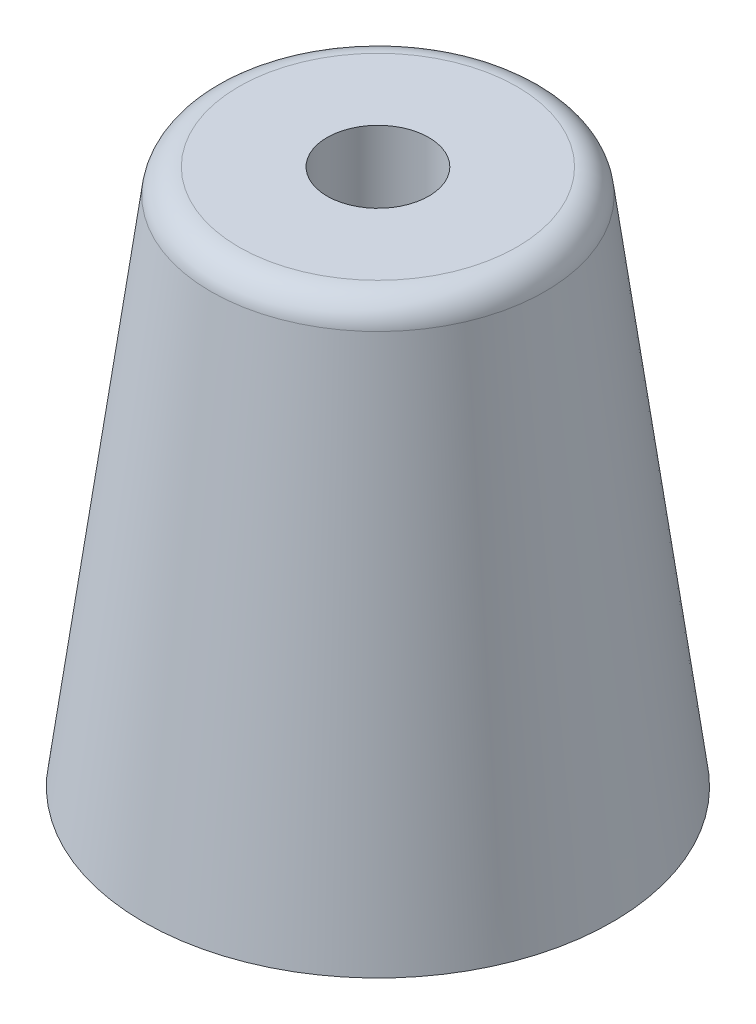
ISO-10303-21;
HEADER;
FILE_DESCRIPTION(('STEP AP214'),'2;1');
FILE_NAME('part.step','',(''),(''),'','','');
FILE_SCHEMA(('AUTOMOTIVE_DESIGN { 1 0 10303 214 1 1 1 1 }'));
ENDSEC;
DATA;
#1=APPLICATION_CONTEXT('core data for automotive mechanical design processes');
#2=APPLICATION_PROTOCOL_DEFINITION('international standard','automotive_design',2000,#1);
#3=PRODUCT_CONTEXT('',#1,'mechanical');
#4=PRODUCT('Part','Part','',(#3));
#5=PRODUCT_RELATED_PRODUCT_CATEGORY('part','',(#4));
#6=PRODUCT_DEFINITION_FORMATION('','',#4);
#7=PRODUCT_DEFINITION_CONTEXT('part definition',#1,'design');
#8=PRODUCT_DEFINITION('design','',#6,#7);
#9=PRODUCT_DEFINITION_SHAPE('','',#8);
#10=(LENGTH_UNIT() NAMED_UNIT(*) SI_UNIT(.MILLI.,.METRE.));
#11=(NAMED_UNIT(*) PLANE_ANGLE_UNIT() SI_UNIT($,.RADIAN.));
#12=(NAMED_UNIT(*) SI_UNIT($,.STERADIAN.) SOLID_ANGLE_UNIT());
#13=UNCERTAINTY_MEASURE_WITH_UNIT(LENGTH_MEASURE(1.E-05),#10,'distance_accuracy_value','');
#14=(GEOMETRIC_REPRESENTATION_CONTEXT(3) GLOBAL_UNCERTAINTY_ASSIGNED_CONTEXT((#13)) GLOBAL_UNIT_ASSIGNED_CONTEXT((#10,
#11,#12)) REPRESENTATION_CONTEXT('',''));
#15=CARTESIAN_POINT('',(0.,0.,0.));
#16=DIRECTION('',(0.,0.,1.));
#17=DIRECTION('',(1.,0.,0.));
#18=AXIS2_PLACEMENT_3D('',#15,#16,#17);
#19=CARTESIAN_POINT('',(0.,45.,0.));
#20=DIRECTION('',(0.,-1.,0.));
#21=DIRECTION('',(0.,0.,-1.));
#22=AXIS2_PLACEMENT_3D('',#19,#20,#21);
#23=PLANE('',#22);
#24=CARTESIAN_POINT('',(0.,45.,0.));
#25=DIRECTION('',(0.,-1.,0.));
#26=DIRECTION('',(0.,0.,-1.));
#27=AXIS2_PLACEMENT_3D('',#24,#25,#26);
#28=CIRCLE('',#27,5.5);
#29=CARTESIAN_POINT('',(0.,45.,-5.5));
#30=VERTEX_POINT('',#29);
#31=EDGE_CURVE('E119',#30,#30,#28,.F.);
#32=ORIENTED_EDGE('',*,*,#31,.T.);
#33=EDGE_LOOP('',(#32));
#34=FACE_BOUND('',#33,.T.);
#35=CARTESIAN_POINT('',(0.,45.,0.));
#36=DIRECTION('',(0.,-1.,0.));
#37=DIRECTION('',(0.,0.,-1.));
#38=AXIS2_PLACEMENT_3D('',#35,#36,#37);
#39=CIRCLE('',#38,22.9422863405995);
#40=CARTESIAN_POINT('',(3.5,45.,-22.6737403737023));
#41=VERTEX_POINT('',#40);
#42=CARTESIAN_POINT('',(-3.49999999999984,45.,-22.6737403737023));
#43=VERTEX_POINT('',#42);
#44=EDGE_CURVE('E116',#41,#43,#39,.T.);
#45=ORIENTED_EDGE('',*,*,#44,.T.);
#46=DIRECTION('',(1.,0.,0.));
#47=VECTOR('',#46,1.);
#48=CARTESIAN_POINT('',(0.,45.,-22.6737403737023));
#49=LINE('',#48,#47);
#50=EDGE_CURVE('E101',#43,#41,#49,.T.);
#51=ORIENTED_EDGE('',*,*,#50,.T.);
#52=EDGE_LOOP('',(#45,#51));
#53=FACE_BOUND('',#52,.T.);
#54=ADVANCED_FACE('F37',(#34,#53),#23,.T.);
#55=CARTESIAN_POINT('',(0.,0.,0.));
#56=DIRECTION('',(0.,-1.,0.));
#57=DIRECTION('',(0.,0.,-1.));
#58=AXIS2_PLACEMENT_3D('',#55,#56,#57);
#59=CONICAL_SURFACE('',#58,35.,0.26179938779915);
#60=CARTESIAN_POINT('',(0.,0.,0.));
#61=DIRECTION('',(0.,-1.,0.));
#62=DIRECTION('',(0.,0.,-1.));
#63=AXIS2_PLACEMENT_3D('',#60,#61,#62);
#64=CIRCLE('',#63,35.);
#65=CARTESIAN_POINT('',(0.,0.,-35.));
#66=VERTEX_POINT('',#65);
#67=EDGE_CURVE('E113',#66,#66,#64,.T.);
#68=ORIENTED_EDGE('',*,*,#67,.T.);
#69=EDGE_LOOP('',(#68));
#70=FACE_BOUND('',#69,.T.);
#71=CARTESIAN_POINT('',(-3.5,62.193847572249,-17.9980521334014));
#72=CARTESIAN_POINT('',(-3.5,59.8519484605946,-18.6372798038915));
#73=CARTESIAN_POINT('',(-3.5,57.5097540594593,-19.2754241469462));
#74=CARTESIAN_POINT('',(-3.5,52.8248968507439,-20.549989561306));
#75=CARTESIAN_POINT('',(-3.5,50.4822340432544,-21.1864106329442));
#76=CARTESIAN_POINT('',(-3.5,45.7965625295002,-22.4579727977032));
#77=CARTESIAN_POINT('',(-3.5,43.4535538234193,-23.0931138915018));
#78=CARTESIAN_POINT('',(-3.5,38.7672636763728,-24.3623895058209));
#79=CARTESIAN_POINT('',(-3.5,36.4239822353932,-24.9965240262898));
#80=CARTESIAN_POINT('',(-3.5,30.8114464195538,-26.514356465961));
#81=CARTESIAN_POINT('',(-3.5,27.5420903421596,-27.3976782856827));
#82=CARTESIAN_POINT('',(-3.5,21.0030666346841,-29.1631703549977));
#83=CARTESIAN_POINT('',(-3.5,17.7333990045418,-30.0453406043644));
#84=CARTESIAN_POINT('',(-3.5,10.4848742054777,-31.9999755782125));
#85=CARTESIAN_POINT('',(-3.5,6.50595992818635,-33.0722285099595));
#86=CARTESIAN_POINT('',(-3.49999999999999,-1.45212984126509,-35.2157647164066));
#87=CARTESIAN_POINT('',(-3.49999999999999,-5.43130533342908,-36.2870479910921));
#88=CARTESIAN_POINT('',(-3.49999999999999,-13.3898530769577,-38.4288739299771));
#89=CARTESIAN_POINT('',(-3.49999999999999,-17.3692253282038,-39.4994165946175));
#90=CARTESIAN_POINT('',(-3.49999999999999,-25.3281276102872,-41.639914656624));
#91=CARTESIAN_POINT('',(-3.49999999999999,-29.3076576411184,-42.709870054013));
#92=CARTESIAN_POINT('',(-3.49999999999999,-33.2872460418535,-43.7796082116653));
#93=B_SPLINE_CURVE_WITH_KNOTS('',3,(#71,#72,#73,#74,#75,#76,#77,#78,#79,#80,#81,#82,#83,#84,#85,
#86,#87,#88,#89,#90,#91,#92),.UNSPECIFIED.,.F.,.F.,(4,2,2,2,2,2,2,2,2,2,4),(0.,7.28271372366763,
14.5654260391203,21.8481344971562,29.1308433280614,39.2905929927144,49.4503446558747,
61.8129237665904,74.175503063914,86.5380749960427,98.9006464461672),.UNSPECIFIED.);
#94=CARTESIAN_POINT('',(-3.5,12.6600265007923,-31.4133768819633));
#95=VERTEX_POINT('',#94);
#96=EDGE_CURVE('E146',#43,#95,#93,.T.);
#97=ORIENTED_EDGE('',*,*,#96,.F.);
#98=ORIENTED_EDGE('',*,*,#44,.F.);
#99=CARTESIAN_POINT('',(3.50000000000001,-33.2872460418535,-43.7796082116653));
#100=CARTESIAN_POINT('',(3.50000000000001,-29.3076550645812,-42.709869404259));
#101=CARTESIAN_POINT('',(3.50000000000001,-25.3281224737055,-41.6399132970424));
#102=CARTESIAN_POINT('',(3.50000000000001,-17.3692151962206,-39.4994138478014));
#103=CARTESIAN_POINT('',(3.50000000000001,-13.3898405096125,-38.4288705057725));
#104=CARTESIAN_POINT('',(3.50000000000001,-5.43129293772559,-36.2870446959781));
#105=CARTESIAN_POINT('',(3.50000000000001,-1.45212005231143,-35.2157622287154));
#106=CARTESIAN_POINT('',(3.5,6.50596463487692,-33.0722270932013));
#107=CARTESIAN_POINT('',(3.5,10.4848764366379,-31.9999744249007));
#108=CARTESIAN_POINT('',(3.5,18.4423517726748,-29.8541651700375));
#109=CARTESIAN_POINT('',(3.5,22.4209153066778,-28.7806085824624));
#110=CARTESIAN_POINT('',(3.5,30.377555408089,-26.6316937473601));
#111=CARTESIAN_POINT('',(3.5,34.3556319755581,-25.5563355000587));
#112=CARTESIAN_POINT('',(3.5,40.3222163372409,-23.9413322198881));
#113=CARTESIAN_POINT('',(3.5,42.3109901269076,-23.4026699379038));
#114=CARTESIAN_POINT('',(3.5,46.2883176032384,-22.3245336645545));
#115=CARTESIAN_POINT('',(3.5,48.276871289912,-21.7850596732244));
#116=CARTESIAN_POINT('',(3.5,52.2537073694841,-20.7051091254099));
#117=CARTESIAN_POINT('',(3.5,54.241989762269,-20.1646325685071));
#118=CARTESIAN_POINT('',(3.5,58.2182026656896,-19.0823855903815));
#119=CARTESIAN_POINT('',(3.5,60.2061331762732,-18.5406151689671));
#120=CARTESIAN_POINT('',(3.5,62.193847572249,-17.9980521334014));
#121=B_SPLINE_CURVE_WITH_KNOTS('',3,(#99,#100,#101,#102,#103,#104,#105,#106,#107,#108,#109,#110,
#111,#112,#113,#114,#115,#116,#117,#118,#119,#120),.UNSPECIFIED.,.F.,.F.,(4,2,2,2,2,2,2,2,2,2,
4),(0.,12.3625794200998,24.7251589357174,37.0877300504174,49.4503017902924,61.8128831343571,
74.1754629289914,80.3567574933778,86.5380517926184,92.7193486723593,98.9006464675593),.UNSPECIFIED.);
#122=CARTESIAN_POINT('',(3.5,12.6600265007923,-31.4133768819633));
#123=VERTEX_POINT('',#122);
#124=EDGE_CURVE('E97',#123,#41,#121,.T.);
#125=ORIENTED_EDGE('',*,*,#124,.F.);
#126=CARTESIAN_POINT('',(3.5,12.6600265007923,-31.4133768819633));
#127=CARTESIAN_POINT('',(3.50000975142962,12.5652421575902,-31.4389269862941));
#128=CARTESIAN_POINT('',(3.49586997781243,12.4705803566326,-31.4649126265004));
#129=CARTESIAN_POINT('',(3.47936729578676,12.2821661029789,-31.517536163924));
#130=CARTESIAN_POINT('',(3.46700496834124,12.1884135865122,-31.5441740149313));
#131=CARTESIAN_POINT('',(3.43414928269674,12.0025602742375,-31.5978603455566));
#132=CARTESIAN_POINT('',(3.4136639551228,11.910457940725,-31.6249083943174));
#133=CARTESIAN_POINT('',(3.36473285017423,11.7284777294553,-31.6791878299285));
#134=CARTESIAN_POINT('',(3.33628712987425,11.6385998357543,-31.706419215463));
#135=CARTESIAN_POINT('',(3.23925416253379,11.3731619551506,-31.7880314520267));
#136=CARTESIAN_POINT('',(3.15895401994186,11.2017017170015,-31.8423582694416));
#137=CARTESIAN_POINT('',(2.96953877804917,10.8748305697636,-31.9485418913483));
#138=CARTESIAN_POINT('',(2.86042622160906,10.7194182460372,-32.0003989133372));
#139=CARTESIAN_POINT('',(2.61598618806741,10.4280858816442,-32.0996299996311));
#140=CARTESIAN_POINT('',(2.48056696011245,10.2922370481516,-32.146987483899));
#141=CARTESIAN_POINT('',(2.18753469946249,10.0442824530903,-32.2348465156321));
#142=CARTESIAN_POINT('',(2.02991745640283,9.93218120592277,-32.2753467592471));
#143=CARTESIAN_POINT('',(1.69655179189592,9.73447649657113,-32.3476343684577));
#144=CARTESIAN_POINT('',(1.52076229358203,9.6489348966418,-32.3794013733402));
#145=CARTESIAN_POINT('',(1.15635365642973,9.50703015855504,-32.4325064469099));
#146=CARTESIAN_POINT('',(0.967742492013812,9.45064906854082,-32.4538509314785));
#147=CARTESIAN_POINT('',(0.64832976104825,9.38244098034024,-32.4797628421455));
#148=CARTESIAN_POINT('',(0.519556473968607,9.36199403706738,-32.4875631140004));
#149=CARTESIAN_POINT('',(0.260540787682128,9.33471531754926,-32.4979866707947));
#150=CARTESIAN_POINT('',(0.130300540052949,9.32786569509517,-32.5006167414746));
#151=CARTESIAN_POINT('',(0.,9.32788091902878,-32.5006018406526));
#152=B_SPLINE_CURVE_WITH_KNOTS('',3,(#126,#127,#128,#129,#130,#131,#132,#133,#134,#135,#136,
#137,#138,#139,#140,#141,#142,#143,#144,#145,#146,#147,#148,#149,#150,#151),.UNSPECIFIED.,.F.,
.F.,(4,2,2,2,2,2,2,2,2,2,2,2,4),(0.,0.294405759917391,0.588790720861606,0.882885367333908,
1.17697790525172,1.76486241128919,2.3526950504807,2.94261595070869,3.53264889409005,
4.12404599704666,4.71507858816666,5.10617073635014,5.49674924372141),.UNSPECIFIED.);
#153=CARTESIAN_POINT('',(0.,9.32788091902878,-32.5006018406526));
#154=VERTEX_POINT('',#153);
#155=EDGE_CURVE('E11',#123,#154,#152,.T.);
#156=ORIENTED_EDGE('',*,*,#155,.T.);
#157=CARTESIAN_POINT('',(0.,9.32788091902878,-32.5006018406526));
#158=CARTESIAN_POINT('',(-0.0981570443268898,9.32787254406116,-32.5006082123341));
#159=CARTESIAN_POINT('',(-0.196309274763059,9.3317582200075,-32.4991183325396));
#160=CARTESIAN_POINT('',(-0.391906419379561,9.34725247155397,-32.4931940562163));
#161=CARTESIAN_POINT('',(-0.489351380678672,9.35886052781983,-32.4887598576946));
#162=CARTESIAN_POINT('',(-0.682755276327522,9.38971929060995,-32.4770006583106));
#163=CARTESIAN_POINT('',(-0.778715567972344,9.40896252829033,-32.4696784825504));
#164=CARTESIAN_POINT('',(-0.968536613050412,9.45494280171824,-32.4522455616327));
#165=CARTESIAN_POINT('',(-1.06239738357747,9.4816797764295,-32.4421348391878));
#166=CARTESIAN_POINT('',(-1.3399103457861,9.57292342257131,-32.4077844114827));
#167=CARTESIAN_POINT('',(-1.51959017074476,9.64847835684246,-32.3795204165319));
#168=CARTESIAN_POINT('',(-1.86280486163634,9.82692718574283,-32.3136988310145));
#169=CARTESIAN_POINT('',(-2.02634125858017,9.92981848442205,-32.2761421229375));
#170=CARTESIAN_POINT('',(-2.33338285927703,10.1606538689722,-32.1933879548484));
#171=CARTESIAN_POINT('',(-2.47682007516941,10.288679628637,-32.148165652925));
#172=CARTESIAN_POINT('',(-2.73899912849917,10.566222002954,-32.0522549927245));
#173=CARTESIAN_POINT('',(-2.85773608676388,10.7157428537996,-32.0015655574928));
#174=CARTESIAN_POINT('',(-3.06742408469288,11.0327103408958,-31.896828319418));
#175=CARTESIAN_POINT('',(-3.15829870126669,11.2002046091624,-31.8427717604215));
#176=CARTESIAN_POINT('',(-3.30916618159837,11.5482219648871,-31.7336933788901));
#177=CARTESIAN_POINT('',(-3.36917820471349,11.7287368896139,-31.6786721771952));
#178=CARTESIAN_POINT('',(-3.4418318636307,12.0352554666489,-31.5882232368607));
#179=CARTESIAN_POINT('',(-3.46362809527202,12.1590669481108,-31.5524572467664));
#180=CARTESIAN_POINT('',(-3.49271207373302,12.4085066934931,-31.4819998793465));
#181=CARTESIAN_POINT('',(-3.50001866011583,12.5341323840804,-31.4473071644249));
#182=CARTESIAN_POINT('',(-3.5,12.6600265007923,-31.4133768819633));
#183=B_SPLINE_CURVE_WITH_KNOTS('',3,(#157,#158,#159,#160,#161,#162,#163,#164,#165,#166,#167,
#168,#169,#170,#171,#172,#173,#174,#175,#176,#177,#178,#179,#180,#181,#182),.UNSPECIFIED.,.F.,
.F.,(4,2,2,2,2,2,2,2,2,2,2,2,4),(0.,0.294374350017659,0.58872890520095,0.882796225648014,
1.17686115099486,1.76469950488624,2.35248205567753,2.94220718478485,3.53204869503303,
4.12349388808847,4.71457147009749,5.10591532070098,5.49675000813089),.UNSPECIFIED.);
#184=EDGE_CURVE('E47',#154,#95,#183,.T.);
#185=ORIENTED_EDGE('',*,*,#184,.T.);
#186=EDGE_LOOP('',(#97,#98,#125,#156,#185));
#187=FACE_BOUND('',#186,.T.);
#188=ADVANCED_FACE('F152',(#70,#187),#59,.F.);
#189=CARTESIAN_POINT('',(0.,0.,0.));
#190=DIRECTION('',(0.,1.,0.));
#191=DIRECTION('',(0.,0.,1.));
#192=AXIS2_PLACEMENT_3D('',#189,#190,#191);
#193=CYLINDRICAL_SURFACE('',#192,5.5);
#194=CARTESIAN_POINT('',(0.,55.,0.));
#195=DIRECTION('',(0.,1.,0.));
#196=DIRECTION('',(0.,0.,1.));
#197=AXIS2_PLACEMENT_3D('',#194,#195,#196);
#198=CIRCLE('',#197,5.5);
#199=CARTESIAN_POINT('',(0.,55.,5.5));
#200=VERTEX_POINT('',#199);
#201=EDGE_CURVE('E120',#200,#200,#198,.T.);
#202=ORIENTED_EDGE('',*,*,#201,.T.);
#203=EDGE_LOOP('',(#202));
#204=FACE_BOUND('',#203,.T.);
#205=ORIENTED_EDGE('',*,*,#31,.F.);
#206=EDGE_LOOP('',(#205));
#207=FACE_BOUND('',#206,.T.);
#208=ADVANCED_FACE('F170',(#204,#207),#193,.F.);
#209=CARTESIAN_POINT('',(0.,0.,0.));
#210=DIRECTION('',(0.,-1.,0.));
#211=DIRECTION('',(0.,0.,1.));
#212=AXIS2_PLACEMENT_3D('',#209,#210,#211);
#213=CONICAL_SURFACE('',#212,41.5,0.130899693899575);
#214=CARTESIAN_POINT('',(0.,90.6526309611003,0.));
#215=DIRECTION('',(0.,-1.,0.));
#216=DIRECTION('',(0.,0.,-1.));
#217=AXIS2_PLACEMENT_3D('',#214,#215,#216);
#218=CIRCLE('',#217,29.5653547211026);
#219=CARTESIAN_POINT('',(0.,90.6526309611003,-29.5653547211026));
#220=VERTEX_POINT('',#219);
#221=EDGE_CURVE('E135',#220,#220,#218,.T.);
#222=ORIENTED_EDGE('',*,*,#221,.T.);
#223=EDGE_LOOP('',(#222));
#224=FACE_BOUND('',#223,.T.);
#225=CARTESIAN_POINT('',(0.,0.,0.));
#226=DIRECTION('',(0.,1.,0.));
#227=DIRECTION('',(0.,0.,1.));
#228=AXIS2_PLACEMENT_3D('',#225,#226,#227);
#229=CIRCLE('',#228,41.5);
#230=CARTESIAN_POINT('',(0.,0.,41.5));
#231=VERTEX_POINT('',#230);
#232=EDGE_CURVE('E127',#231,#231,#229,.T.);
#233=ORIENTED_EDGE('',*,*,#232,.T.);
#234=EDGE_LOOP('',(#233));
#235=FACE_BOUND('',#234,.T.);
#236=ADVANCED_FACE('F203',(#224,#235),#213,.T.);
#237=CARTESIAN_POINT('',(0.,95.,0.));
#238=DIRECTION('',(0.,1.,0.));
#239=DIRECTION('',(0.,0.,1.));
#240=AXIS2_PLACEMENT_3D('',#237,#238,#239);
#241=PLANE('',#240);
#242=CARTESIAN_POINT('',(0.,95.,0.));
#243=DIRECTION('',(0.,1.,0.));
#244=DIRECTION('',(0.,0.,1.));
#245=AXIS2_PLACEMENT_3D('',#242,#243,#244);
#246=CIRCLE('',#245,9.);
#247=CARTESIAN_POINT('',(0.,95.,9.));
#248=VERTEX_POINT('',#247);
#249=EDGE_CURVE('E123',#248,#248,#246,.T.);
#250=ORIENTED_EDGE('',*,*,#249,.F.);
#251=EDGE_LOOP('',(#250));
#252=FACE_BOUND('',#251,.T.);
#253=CARTESIAN_POINT('',(0.,95.,0.));
#254=DIRECTION('',(0.,1.,0.));
#255=DIRECTION('',(0.,0.,1.));
#256=AXIS2_PLACEMENT_3D('',#253,#254,#255);
#257=CIRCLE('',#256,24.6081304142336);
#258=CARTESIAN_POINT('',(0.,95.,24.6081304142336));
#259=VERTEX_POINT('',#258);
#260=EDGE_CURVE('E132',#259,#259,#257,.T.);
#261=ORIENTED_EDGE('',*,*,#260,.T.);
#262=EDGE_LOOP('',(#261));
#263=FACE_BOUND('',#262,.T.);
#264=ADVANCED_FACE('F206',(#252,#263),#241,.T.);
#265=CARTESIAN_POINT('',(0.,0.,0.));
#266=DIRECTION('',(0.,1.,0.));
#267=DIRECTION('',(0.,0.,1.));
#268=AXIS2_PLACEMENT_3D('',#265,#266,#267);
#269=PLANE('',#268);
#270=ORIENTED_EDGE('',*,*,#67,.F.);
#271=EDGE_LOOP('',(#270));
#272=FACE_BOUND('',#271,.T.);
#273=ORIENTED_EDGE('',*,*,#232,.F.);
#274=EDGE_LOOP('',(#273));
#275=FACE_BOUND('',#274,.T.);
#276=ADVANCED_FACE('F201',(#272,#275),#269,.F.);
#277=CARTESIAN_POINT('',(0.,90.,0.));
#278=DIRECTION('',(0.,1.,0.));
#279=DIRECTION('',(0.,0.,1.));
#280=AXIS2_PLACEMENT_3D('',#277,#278,#279);
#281=TOROIDAL_SURFACE('',#280,24.6081304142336,5.);
#282=ORIENTED_EDGE('',*,*,#221,.F.);
#283=EDGE_LOOP('',(#282));
#284=FACE_BOUND('',#283,.T.);
#285=ORIENTED_EDGE('',*,*,#260,.F.);
#286=EDGE_LOOP('',(#285));
#287=FACE_BOUND('',#286,.T.);
#288=ADVANCED_FACE('F197',(#284,#287),#281,.T.);
#289=CARTESIAN_POINT('',(0.,55.,0.));
#290=DIRECTION('',(0.,1.,0.));
#291=DIRECTION('',(0.,0.,1.));
#292=AXIS2_PLACEMENT_3D('',#289,#290,#291);
#293=CYLINDRICAL_SURFACE('',#292,9.);
#294=CARTESIAN_POINT('',(0.,55.,0.));
#295=DIRECTION('',(0.,1.,0.));
#296=DIRECTION('',(0.,0.,1.));
#297=AXIS2_PLACEMENT_3D('',#294,#295,#296);
#298=CIRCLE('',#297,9.);
#299=CARTESIAN_POINT('',(0.,55.,9.));
#300=VERTEX_POINT('',#299);
#301=EDGE_CURVE('E124',#300,#300,#298,.T.);
#302=ORIENTED_EDGE('',*,*,#301,.F.);
#303=EDGE_LOOP('',(#302));
#304=FACE_BOUND('',#303,.T.);
#305=ORIENTED_EDGE('',*,*,#249,.T.);
#306=EDGE_LOOP('',(#305));
#307=FACE_BOUND('',#306,.T.);
#308=ADVANCED_FACE('F200',(#304,#307),#293,.F.);
#309=CARTESIAN_POINT('',(0.,55.,0.));
#310=DIRECTION('',(0.,1.,0.));
#311=DIRECTION('',(0.,0.,1.));
#312=AXIS2_PLACEMENT_3D('',#309,#310,#311);
#313=PLANE('',#312);
#314=ORIENTED_EDGE('',*,*,#201,.F.);
#315=EDGE_LOOP('',(#314));
#316=FACE_BOUND('',#315,.T.);
#317=ORIENTED_EDGE('',*,*,#301,.T.);
#318=EDGE_LOOP('',(#317));
#319=FACE_BOUND('',#318,.T.);
#320=ADVANCED_FACE('F163',(#316,#319),#313,.T.);
#321=CARTESIAN_POINT('',(-3.5,44.5496526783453,-20.9930212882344));
#322=DIRECTION('',(1.,0.,0.));
#323=DIRECTION('',(0.,1.,0.));
#324=AXIS2_PLACEMENT_3D('',#321,#322,#323);
#325=PLANE('',#324);
#326=ORIENTED_EDGE('',*,*,#96,.T.);
#327=DIRECTION('',(0.,0.258819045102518,-0.965925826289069));
#328=VECTOR('',#327,1.);
#329=CARTESIAN_POINT('',(-3.5,12.1911374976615,-29.6634592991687));
#330=LINE('',#329,#328);
#331=CARTESIAN_POINT('',(-3.5,12.1911374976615,-29.6634592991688));
#332=VERTEX_POINT('',#331);
#333=EDGE_CURVE('E177',#95,#332,#330,.F.);
#334=ORIENTED_EDGE('',*,*,#333,.T.);
#335=DIRECTION('',(0.,-0.965925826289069,-0.258819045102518));
#336=VECTOR('',#335,1.);
#337=CARTESIAN_POINT('',(-3.5,44.5496526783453,-20.9930212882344));
#338=LINE('',#337,#336);
#339=CARTESIAN_POINT('',(-3.5,44.5496526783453,-20.9930212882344));
#340=VERTEX_POINT('',#339);
#341=EDGE_CURVE('E92',#340,#332,#338,.T.);
#342=ORIENTED_EDGE('',*,*,#341,.F.);
#343=DIRECTION('',(0.,0.258819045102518,-0.965925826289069));
#344=VECTOR('',#343,1.);
#345=CARTESIAN_POINT('',(-3.5,44.5496526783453,-20.9930212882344));
#346=LINE('',#345,#344);
#347=EDGE_CURVE('E102',#340,#43,#346,.T.);
#348=ORIENTED_EDGE('',*,*,#347,.T.);
#349=EDGE_LOOP('',(#326,#334,#342,#348));
#350=FACE_BOUND('',#349,.T.);
#351=ADVANCED_FACE('F159',(#350),#325,.F.);
#352=CARTESIAN_POINT('',(3.5,44.5496526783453,-20.9930212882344));
#353=DIRECTION('',(-1.,0.,0.));
#354=DIRECTION('',(0.,-1.,0.));
#355=AXIS2_PLACEMENT_3D('',#352,#353,#354);
#356=PLANE('',#355);
#357=DIRECTION('',(0.,0.965925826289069,0.258819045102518));
#358=VECTOR('',#357,1.);
#359=CARTESIAN_POINT('',(3.5,44.5496526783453,-20.9930212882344));
#360=LINE('',#359,#358);
#361=CARTESIAN_POINT('',(3.5,12.1911374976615,-29.6634592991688));
#362=VERTEX_POINT('',#361);
#363=CARTESIAN_POINT('',(3.5,44.5496526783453,-20.9930212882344));
#364=VERTEX_POINT('',#363);
#365=EDGE_CURVE('E83',#362,#364,#360,.T.);
#366=ORIENTED_EDGE('',*,*,#365,.F.);
#367=DIRECTION('',(0.,0.258819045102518,-0.965925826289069));
#368=VECTOR('',#367,1.);
#369=CARTESIAN_POINT('',(3.5,12.1911374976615,-29.6634592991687));
#370=LINE('',#369,#368);
#371=EDGE_CURVE('E60',#362,#123,#370,.T.);
#372=ORIENTED_EDGE('',*,*,#371,.T.);
#373=ORIENTED_EDGE('',*,*,#124,.T.);
#374=DIRECTION('',(0.,0.258819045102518,-0.965925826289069));
#375=VECTOR('',#374,1.);
#376=CARTESIAN_POINT('',(3.5,44.5496526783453,-20.9930212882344));
#377=LINE('',#376,#375);
#378=EDGE_CURVE('E95',#364,#41,#377,.T.);
#379=ORIENTED_EDGE('',*,*,#378,.F.);
#380=EDGE_LOOP('',(#366,#372,#373,#379));
#381=FACE_BOUND('',#380,.T.);
#382=ADVANCED_FACE('F96',(#381),#356,.F.);
#383=CARTESIAN_POINT('',(-3.5,44.5496526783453,-20.9930212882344));
#384=DIRECTION('',(0.,-0.965925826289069,-0.258819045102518));
#385=DIRECTION('',(0.,0.258819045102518,-0.965925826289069));
#386=AXIS2_PLACEMENT_3D('',#383,#384,#385);
#387=PLANE('',#386);
#388=ORIENTED_EDGE('',*,*,#50,.F.);
#389=ORIENTED_EDGE('',*,*,#347,.F.);
#390=DIRECTION('',(-1.,0.,0.));
#391=VECTOR('',#390,1.);
#392=CARTESIAN_POINT('',(-3.5,44.5496526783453,-20.9930212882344));
#393=LINE('',#392,#391);
#394=EDGE_CURVE('E88',#364,#340,#393,.T.);
#395=ORIENTED_EDGE('',*,*,#394,.F.);
#396=ORIENTED_EDGE('',*,*,#378,.T.);
#397=EDGE_LOOP('',(#388,#389,#395,#396));
#398=FACE_BOUND('',#397,.T.);
#399=ADVANCED_FACE('F104',(#398),#387,.F.);
#400=CARTESIAN_POINT('',(-3.5,44.5496526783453,-20.9930212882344));
#401=DIRECTION('',(0.,-0.258819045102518,0.965925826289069));
#402=DIRECTION('',(0.,-0.965925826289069,-0.258819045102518));
#403=AXIS2_PLACEMENT_3D('',#400,#401,#402);
#404=PLANE('',#403);
#405=ORIENTED_EDGE('',*,*,#341,.T.);
#406=CARTESIAN_POINT('',(0.,12.1911374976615,-29.6634592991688));
#407=DIRECTION('',(0.,-0.258819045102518,0.965925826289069));
#408=DIRECTION('',(0.,-0.965925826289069,-0.258819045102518));
#409=AXIS2_PLACEMENT_3D('',#406,#407,#408);
#410=CIRCLE('',#409,3.5);
#411=CARTESIAN_POINT('',(0.,8.81039710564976,-30.5693259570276));
#412=VERTEX_POINT('',#411);
#413=EDGE_CURVE('E182',#332,#412,#410,.T.);
#414=ORIENTED_EDGE('',*,*,#413,.T.);
#415=CARTESIAN_POINT('',(0.,12.1911374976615,-29.6634592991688));
#416=DIRECTION('',(0.,-0.258819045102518,0.965925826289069));
#417=DIRECTION('',(0.,-0.965925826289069,-0.258819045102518));
#418=AXIS2_PLACEMENT_3D('',#415,#416,#417);
#419=CIRCLE('',#418,3.5);
#420=EDGE_CURVE('E91',#412,#362,#419,.T.);
#421=ORIENTED_EDGE('',*,*,#420,.T.);
#422=ORIENTED_EDGE('',*,*,#365,.T.);
#423=ORIENTED_EDGE('',*,*,#394,.T.);
#424=EDGE_LOOP('',(#405,#414,#421,#422,#423));
#425=FACE_BOUND('',#424,.T.);
#426=ADVANCED_FACE('F86',(#425),#404,.T.);
#427=CARTESIAN_POINT('',(0.,12.1911374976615,-29.6634592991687));
#428=DIRECTION('',(0.,0.258819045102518,-0.965925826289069));
#429=DIRECTION('',(0.,0.965925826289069,0.258819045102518));
#430=AXIS2_PLACEMENT_3D('',#427,#428,#429);
#431=CYLINDRICAL_SURFACE('',#430,3.5);
#432=ORIENTED_EDGE('',*,*,#371,.F.);
#433=ORIENTED_EDGE('',*,*,#420,.F.);
#434=DIRECTION('',(0.,0.258819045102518,-0.965925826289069));
#435=VECTOR('',#434,1.);
#436=CARTESIAN_POINT('',(0.,8.81039710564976,-30.5693259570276));
#437=LINE('',#436,#435);
#438=EDGE_CURVE('E42',#154,#412,#437,.F.);
#439=ORIENTED_EDGE('',*,*,#438,.F.);
#440=ORIENTED_EDGE('',*,*,#155,.F.);
#441=EDGE_LOOP('',(#432,#433,#439,#440));
#442=FACE_BOUND('',#441,.T.);
#443=ADVANCED_FACE('F39',(#442),#431,.T.);
#444=CARTESIAN_POINT('',(0.,12.1911374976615,-29.6634592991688));
#445=DIRECTION('',(0.,0.258819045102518,-0.965925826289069));
#446=DIRECTION('',(0.,0.965925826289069,0.258819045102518));
#447=AXIS2_PLACEMENT_3D('',#444,#445,#446);
#448=CYLINDRICAL_SURFACE('',#447,3.5);
#449=ORIENTED_EDGE('',*,*,#413,.F.);
#450=ORIENTED_EDGE('',*,*,#333,.F.);
#451=ORIENTED_EDGE('',*,*,#184,.F.);
#452=ORIENTED_EDGE('',*,*,#438,.T.);
#453=EDGE_LOOP('',(#449,#450,#451,#452));
#454=FACE_BOUND('',#453,.T.);
#455=ADVANCED_FACE('F181',(#454),#448,.T.);
#456=CLOSED_SHELL('',(#54,#188,#208,#236,#264,#276,#288,#308,#320,#351,#382,#399,#426,#443,#455));
#457=MANIFOLD_SOLID_BREP('B2',#456);
#458=ADVANCED_BREP_SHAPE_REPRESENTATION('',(#18,#457),#14);
#459=SHAPE_DEFINITION_REPRESENTATION(#9,#458);
ENDSEC;
END-ISO-10303-21;
